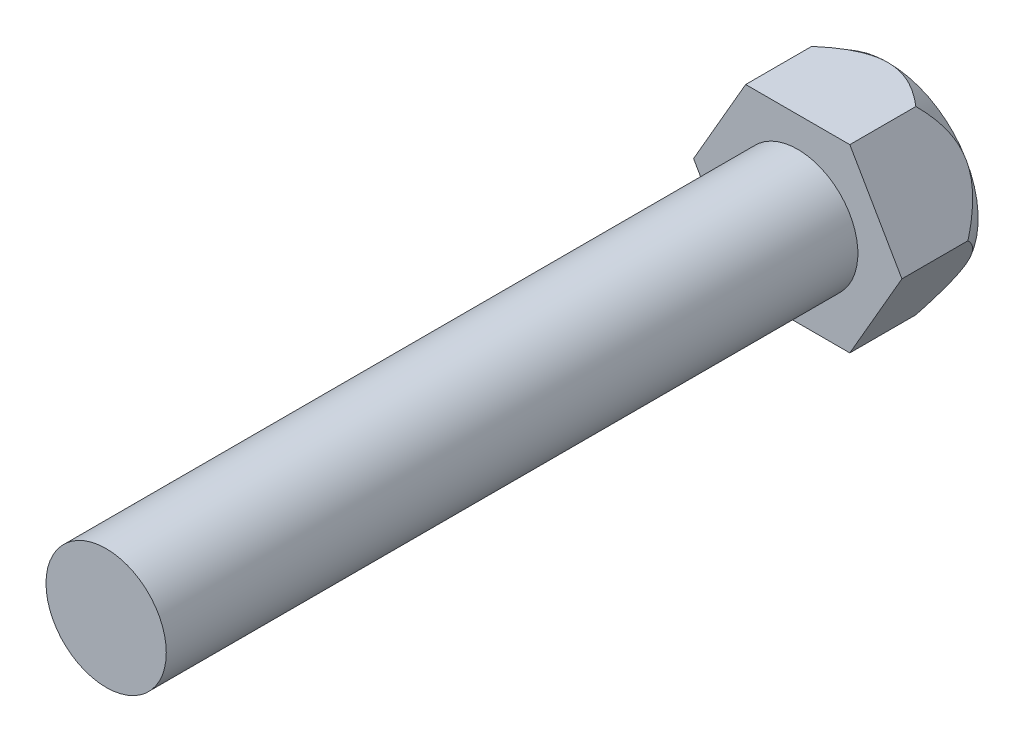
ISO-10303-21;
HEADER;
FILE_DESCRIPTION(('STEP AP214'),'2;1');
FILE_NAME('part.step','',(''),(''),'','','');
FILE_SCHEMA(('AUTOMOTIVE_DESIGN { 1 0 10303 214 1 1 1 1 }'));
ENDSEC;
DATA;
#1=APPLICATION_CONTEXT('core data for automotive mechanical design processes');
#2=APPLICATION_PROTOCOL_DEFINITION('international standard','automotive_design',2000,#1);
#3=PRODUCT_CONTEXT('',#1,'mechanical');
#4=PRODUCT('Part','Part','',(#3));
#5=PRODUCT_RELATED_PRODUCT_CATEGORY('part','',(#4));
#6=PRODUCT_DEFINITION_FORMATION('','',#4);
#7=PRODUCT_DEFINITION_CONTEXT('part definition',#1,'design');
#8=PRODUCT_DEFINITION('design','',#6,#7);
#9=PRODUCT_DEFINITION_SHAPE('','',#8);
#10=(LENGTH_UNIT() NAMED_UNIT(*) SI_UNIT(.MILLI.,.METRE.));
#11=(NAMED_UNIT(*) PLANE_ANGLE_UNIT() SI_UNIT($,.RADIAN.));
#12=(NAMED_UNIT(*) SI_UNIT($,.STERADIAN.) SOLID_ANGLE_UNIT());
#13=UNCERTAINTY_MEASURE_WITH_UNIT(LENGTH_MEASURE(1.E-05),#10,'distance_accuracy_value','');
#14=(GEOMETRIC_REPRESENTATION_CONTEXT(3) GLOBAL_UNCERTAINTY_ASSIGNED_CONTEXT((#13)) GLOBAL_UNIT_ASSIGNED_CONTEXT((#10,
#11,#12)) REPRESENTATION_CONTEXT('',''));
#15=CARTESIAN_POINT('',(0.,0.,0.));
#16=DIRECTION('',(0.,0.,1.));
#17=DIRECTION('',(1.,0.,0.));
#18=AXIS2_PLACEMENT_3D('',#15,#16,#17);
#19=CARTESIAN_POINT('',(0.,0.,57.5));
#20=DIRECTION('',(0.,0.,-1.));
#21=DIRECTION('',(-1.,0.,0.));
#22=AXIS2_PLACEMENT_3D('',#19,#20,#21);
#23=CYLINDRICAL_SURFACE('',#22,10.);
#24=CARTESIAN_POINT('',(0.,0.,57.5));
#25=DIRECTION('',(0.,0.,1.));
#26=DIRECTION('',(1.,0.,0.));
#27=AXIS2_PLACEMENT_3D('',#24,#25,#26);
#28=CIRCLE('',#27,10.);
#29=CARTESIAN_POINT('',(10.,0.,57.5));
#30=VERTEX_POINT('',#29);
#31=EDGE_CURVE('E148',#30,#30,#28,.T.);
#32=ORIENTED_EDGE('',*,*,#31,.F.);
#33=EDGE_LOOP('',(#32));
#34=FACE_BOUND('',#33,.T.);
#35=CARTESIAN_POINT('',(0.,0.,-57.5));
#36=DIRECTION('',(0.,0.,-1.));
#37=DIRECTION('',(-1.,0.,0.));
#38=AXIS2_PLACEMENT_3D('',#35,#36,#37);
#39=CIRCLE('',#38,10.);
#40=CARTESIAN_POINT('',(-10.,0.,-57.5));
#41=VERTEX_POINT('',#40);
#42=EDGE_CURVE('E146',#41,#41,#39,.T.);
#43=ORIENTED_EDGE('',*,*,#42,.F.);
#44=EDGE_LOOP('',(#43));
#45=FACE_BOUND('',#44,.T.);
#46=ADVANCED_FACE('F40',(#34,#45),#23,.T.);
#47=CARTESIAN_POINT('',(0.,0.,57.5));
#48=DIRECTION('',(0.,0.,1.));
#49=DIRECTION('',(1.,0.,0.));
#50=AXIS2_PLACEMENT_3D('',#47,#48,#49);
#51=PLANE('',#50);
#52=ORIENTED_EDGE('',*,*,#31,.T.);
#53=EDGE_LOOP('',(#52));
#54=FACE_BOUND('',#53,.T.);
#55=ADVANCED_FACE('F233',(#54),#51,.T.);
#56=CARTESIAN_POINT('',(-8.66025403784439,-15.,-72.5));
#57=DIRECTION('',(0.866025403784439,0.5,0.));
#58=DIRECTION('',(-0.5,0.866025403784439,0.));
#59=AXIS2_PLACEMENT_3D('',#56,#57,#58);
#60=PLANE('',#59);
#61=DIRECTION('',(0.,0.,1.));
#62=VECTOR('',#61,1.);
#63=CARTESIAN_POINT('',(-17.3205080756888,0.,-72.5));
#64=LINE('',#63,#62);
#65=CARTESIAN_POINT('',(-17.3205080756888,0.,-68.4807621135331));
#66=VERTEX_POINT('',#65);
#67=CARTESIAN_POINT('',(-17.3205080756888,0.,-57.5));
#68=VERTEX_POINT('',#67);
#69=EDGE_CURVE('E144',#66,#68,#64,.T.);
#70=ORIENTED_EDGE('',*,*,#69,.F.);
#71=CARTESIAN_POINT('',(-17.3206235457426,0.000200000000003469,-68.4805621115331));
#72=CARTESIAN_POINT('',(-17.2300479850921,-0.156681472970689,-68.637426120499));
#73=CARTESIAN_POINT('',(-17.1385624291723,-0.315139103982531,-68.7922150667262));
#74=CARTESIAN_POINT('',(-16.9535845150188,-0.635530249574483,-69.0970249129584));
#75=CARTESIAN_POINT('',(-16.8600915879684,-0.797464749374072,-69.2470444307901));
#76=CARTESIAN_POINT('',(-16.6704659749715,-1.1259059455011,-69.5423822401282));
#77=CARTESIAN_POINT('',(-16.5743219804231,-1.29243222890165,-69.687671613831));
#78=CARTESIAN_POINT('',(-16.3797159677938,-1.62949973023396,-69.9718551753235));
#79=CARTESIAN_POINT('',(-16.2812541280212,-1.80004063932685,-70.1107498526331));
#80=CARTESIAN_POINT('',(-15.9769616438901,-2.32709068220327,-70.5234775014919));
#81=CARTESIAN_POINT('',(-15.7670945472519,-2.69059115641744,-70.7856331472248));
#82=CARTESIAN_POINT('',(-15.3360147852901,-3.43724320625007,-71.2681385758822));
#83=CARTESIAN_POINT('',(-15.1148286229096,-3.8203488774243,-71.4885808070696));
#84=CARTESIAN_POINT('',(-14.7642585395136,-4.42755407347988,-71.7864245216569));
#85=CARTESIAN_POINT('',(-14.6389809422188,-4.64454123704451,-71.883227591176));
#86=CARTESIAN_POINT('',(-14.385145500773,-5.08419711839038,-72.058066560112));
#87=CARTESIAN_POINT('',(-14.2565874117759,-5.30686626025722,-72.136101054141));
#88=CARTESIAN_POINT('',(-13.9977321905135,-5.75521665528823,-72.2704162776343));
#89=CARTESIAN_POINT('',(-13.8674571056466,-5.98085972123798,-72.3268655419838));
#90=CARTESIAN_POINT('',(-13.6049313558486,-6.43556765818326,-72.4168514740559));
#91=CARTESIAN_POINT('',(-13.4726808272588,-6.66463229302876,-72.4503897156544));
#92=CARTESIAN_POINT('',(-13.2059740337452,-7.12658201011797,-72.4934006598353));
#93=CARTESIAN_POINT('',(-13.0715086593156,-7.35948287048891,-72.502650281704));
#94=CARTESIAN_POINT('',(-12.8027354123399,-7.82501178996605,-72.4960396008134));
#95=CARTESIAN_POINT('',(-12.6684275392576,-8.05763985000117,-72.4801793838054));
#96=CARTESIAN_POINT('',(-12.400784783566,-8.5212107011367,-72.4239623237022));
#97=CARTESIAN_POINT('',(-12.2674530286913,-8.752148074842,-72.3835464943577));
#98=CARTESIAN_POINT('',(-12.003049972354,-9.21010760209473,-72.2797957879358));
#99=CARTESIAN_POINT('',(-11.8719789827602,-9.43712921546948,-72.2164577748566));
#100=CARTESIAN_POINT('',(-11.5753276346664,-9.95094442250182,-72.0477759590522));
#101=CARTESIAN_POINT('',(-11.4107215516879,-10.2360505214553,-71.9355824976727));
#102=CARTESIAN_POINT('',(-11.0872128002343,-10.7963841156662,-71.6821410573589));
#103=CARTESIAN_POINT('',(-10.9283126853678,-11.0716071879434,-71.5408802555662));
#104=CARTESIAN_POINT('',(-10.6157889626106,-11.6129141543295,-71.2338608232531));
#105=CARTESIAN_POINT('',(-10.4621898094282,-11.878955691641,-71.0680035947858));
#106=CARTESIAN_POINT('',(-10.1607574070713,-12.4010519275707,-70.7167667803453));
#107=CARTESIAN_POINT('',(-10.012923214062,-12.6571082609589,-70.5313904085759));
#108=CARTESIAN_POINT('',(-9.76139050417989,-13.0927756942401,-70.1964736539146));
#109=CARTESIAN_POINT('',(-9.65645845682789,-13.274523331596,-70.0506016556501));
#110=CARTESIAN_POINT('',(-9.44924972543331,-13.6334193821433,-69.7515279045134));
#111=CARTESIAN_POINT('',(-9.34697290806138,-13.8105680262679,-69.5983265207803));
#112=CARTESIAN_POINT('',(-9.14600894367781,-14.1586478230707,-69.287365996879));
#113=CARTESIAN_POINT('',(-9.04729436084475,-14.3296264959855,-69.1296774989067));
#114=CARTESIAN_POINT('',(-8.85209596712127,-14.6677200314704,-68.808945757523));
#115=CARTESIAN_POINT('',(-8.75561170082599,-14.8348356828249,-68.6459036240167));
#116=CARTESIAN_POINT('',(-8.66013856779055,-15.0002,-68.4805621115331));
#117=B_SPLINE_CURVE_WITH_KNOTS('',3,(#71,#72,#73,#74,#75,#76,#77,#78,#79,#80,#81,#82,#83,#84,
#85,#86,#87,#88,#89,#90,#91,#92,#93,#94,#95,#96,#97,#98,#99,#100,#101,#102,#103,#104,#105,#106,
#107,#108,#109,#110,#111,#112,#113,#114,#115,#116),.UNSPECIFIED.,.F.,.F.,(4,2,2,2,2,2,2,2,2,2,2,
2,2,2,2,2,2,2,2,2,2,2,4),(0.,0.718895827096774,1.43799812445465,2.16088732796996,
2.88372110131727,4.36659494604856,5.84614282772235,6.65134572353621,7.45660889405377,
8.25544963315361,9.05423549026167,9.86033260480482,10.6664269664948,11.474465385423,
12.2826143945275,13.3243244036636,14.3664949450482,15.4129621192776,16.4592572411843,
17.2258390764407,17.9923823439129,18.7503041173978,19.5080697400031),.UNSPECIFIED.);
#118=CARTESIAN_POINT('',(-12.9903810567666,-7.49999999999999,-72.5));
#119=VERTEX_POINT('',#118);
#120=EDGE_CURVE('E128',#66,#119,#117,.T.);
#121=ORIENTED_EDGE('',*,*,#120,.T.);
#122=CARTESIAN_POINT('',(-8.66025403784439,-15.,-68.4807621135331));
#123=VERTEX_POINT('',#122);
#124=EDGE_CURVE('E198',#119,#123,#117,.T.);
#125=ORIENTED_EDGE('',*,*,#124,.T.);
#126=DIRECTION('',(0.,0.,1.));
#127=VECTOR('',#126,1.);
#128=CARTESIAN_POINT('',(-8.66025403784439,-15.,-72.5));
#129=LINE('',#128,#127);
#130=CARTESIAN_POINT('',(-8.66025403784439,-15.,-57.5));
#131=VERTEX_POINT('',#130);
#132=EDGE_CURVE('E139',#123,#131,#129,.T.);
#133=ORIENTED_EDGE('',*,*,#132,.T.);
#134=DIRECTION('',(-0.5,0.866025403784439,0.));
#135=VECTOR('',#134,1.);
#136=CARTESIAN_POINT('',(-8.66025403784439,-15.,-57.5));
#137=LINE('',#136,#135);
#138=EDGE_CURVE('E253',#131,#68,#137,.T.);
#139=ORIENTED_EDGE('',*,*,#138,.T.);
#140=EDGE_LOOP('',(#70,#121,#125,#133,#139));
#141=FACE_BOUND('',#140,.T.);
#142=ADVANCED_FACE('F228',(#141),#60,.F.);
#143=CARTESIAN_POINT('',(-17.3205080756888,0.,-72.5));
#144=DIRECTION('',(0.866025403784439,-0.5,0.));
#145=DIRECTION('',(0.5,0.866025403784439,0.));
#146=AXIS2_PLACEMENT_3D('',#143,#144,#145);
#147=PLANE('',#146);
#148=DIRECTION('',(0.,0.,1.));
#149=VECTOR('',#148,1.);
#150=CARTESIAN_POINT('',(-8.66025403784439,15.,-72.5));
#151=LINE('',#150,#149);
#152=CARTESIAN_POINT('',(-8.66025403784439,15.,-68.4807621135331));
#153=VERTEX_POINT('',#152);
#154=CARTESIAN_POINT('',(-8.66025403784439,15.,-57.5));
#155=VERTEX_POINT('',#154);
#156=EDGE_CURVE('E137',#153,#155,#151,.T.);
#157=ORIENTED_EDGE('',*,*,#156,.F.);
#158=CARTESIAN_POINT('',(-8.66013856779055,15.0002,-68.4805621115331));
#159=CARTESIAN_POINT('',(-8.75071412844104,14.8433185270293,-68.637426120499));
#160=CARTESIAN_POINT('',(-8.84219968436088,14.6848608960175,-68.7922150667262));
#161=CARTESIAN_POINT('',(-9.02717759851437,14.3644697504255,-69.0970249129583));
#162=CARTESIAN_POINT('',(-9.12067052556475,14.2025352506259,-69.2470444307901));
#163=CARTESIAN_POINT('',(-9.31029613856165,13.8740940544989,-69.5423822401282));
#164=CARTESIAN_POINT('',(-9.40644013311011,13.7075677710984,-69.687671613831));
#165=CARTESIAN_POINT('',(-9.6010461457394,13.370500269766,-69.9718551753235));
#166=CARTESIAN_POINT('',(-9.69950798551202,13.1999593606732,-70.1107498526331));
#167=CARTESIAN_POINT('',(-10.0038004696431,12.6729093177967,-70.5234775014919));
#168=CARTESIAN_POINT('',(-10.2136675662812,12.3094088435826,-70.7856331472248));
#169=CARTESIAN_POINT('',(-10.6447473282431,11.5627567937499,-71.2681385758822));
#170=CARTESIAN_POINT('',(-10.8659334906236,11.1796511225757,-71.4885808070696));
#171=CARTESIAN_POINT('',(-11.2165035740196,10.5724459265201,-71.7864245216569));
#172=CARTESIAN_POINT('',(-11.3417811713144,10.3554587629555,-71.883227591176));
#173=CARTESIAN_POINT('',(-11.5956166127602,9.91580288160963,-72.058066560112));
#174=CARTESIAN_POINT('',(-11.7241747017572,9.69313373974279,-72.136101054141));
#175=CARTESIAN_POINT('',(-11.9830299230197,9.24478334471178,-72.2704162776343));
#176=CARTESIAN_POINT('',(-12.1133050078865,9.01914027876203,-72.3268655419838));
#177=CARTESIAN_POINT('',(-12.3758307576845,8.56443234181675,-72.4168514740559));
#178=CARTESIAN_POINT('',(-12.5080812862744,8.33536770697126,-72.4503897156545));
#179=CARTESIAN_POINT('',(-12.7747880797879,7.87341798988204,-72.4934006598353));
#180=CARTESIAN_POINT('',(-12.9092534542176,7.64051712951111,-72.502650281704));
#181=CARTESIAN_POINT('',(-13.1780267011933,7.17498821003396,-72.4960396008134));
#182=CARTESIAN_POINT('',(-13.3123345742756,6.94236014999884,-72.4801793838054));
#183=CARTESIAN_POINT('',(-13.5799773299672,6.47878929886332,-72.4239623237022));
#184=CARTESIAN_POINT('',(-13.7133090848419,6.24785192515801,-72.3835464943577));
#185=CARTESIAN_POINT('',(-13.9777121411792,5.78989239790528,-72.2797957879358));
#186=CARTESIAN_POINT('',(-14.108783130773,5.56287078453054,-72.2164577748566));
#187=CARTESIAN_POINT('',(-14.4054344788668,5.0490555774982,-72.0477759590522));
#188=CARTESIAN_POINT('',(-14.5700405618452,4.76394947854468,-71.9355824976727));
#189=CARTESIAN_POINT('',(-14.8935493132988,4.20361588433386,-71.6821410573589));
#190=CARTESIAN_POINT('',(-15.0524494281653,3.92839281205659,-71.5408802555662));
#191=CARTESIAN_POINT('',(-15.3649731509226,3.38708584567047,-71.2338608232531));
#192=CARTESIAN_POINT('',(-15.518572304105,3.12104430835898,-71.0680035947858));
#193=CARTESIAN_POINT('',(-15.8200047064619,2.59894807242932,-70.7167667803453));
#194=CARTESIAN_POINT('',(-15.9678388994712,2.34289173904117,-70.5313904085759));
#195=CARTESIAN_POINT('',(-16.2193716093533,1.90722430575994,-70.1964736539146));
#196=CARTESIAN_POINT('',(-16.3243036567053,1.72547666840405,-70.0506016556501));
#197=CARTESIAN_POINT('',(-16.5315123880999,1.36658061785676,-69.7515279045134));
#198=CARTESIAN_POINT('',(-16.6337892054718,1.18943197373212,-69.5983265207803));
#199=CARTESIAN_POINT('',(-16.8347531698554,0.841352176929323,-69.287365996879));
#200=CARTESIAN_POINT('',(-16.9334677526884,0.670373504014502,-69.1296774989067));
#201=CARTESIAN_POINT('',(-17.1286661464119,0.332279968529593,-68.808945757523));
#202=CARTESIAN_POINT('',(-17.2251504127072,0.16516431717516,-68.6459036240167));
#203=CARTESIAN_POINT('',(-17.3206235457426,-0.000199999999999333,-68.4805621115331));
#204=B_SPLINE_CURVE_WITH_KNOTS('',3,(#158,#159,#160,#161,#162,#163,#164,#165,#166,#167,#168,
#169,#170,#171,#172,#173,#174,#175,#176,#177,#178,#179,#180,#181,#182,#183,#184,#185,#186,#187,
#188,#189,#190,#191,#192,#193,#194,#195,#196,#197,#198,#199,#200,#201,#202,#203),.UNSPECIFIED.,
.F.,.F.,(4,2,2,2,2,2,2,2,2,2,2,2,2,2,2,2,2,2,2,2,2,2,4),(0.,0.718895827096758,1.43799812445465,
2.16088732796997,2.88372110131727,4.36659494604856,5.84614282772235,6.65134572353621,
7.45660889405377,8.25544963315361,9.05423549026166,9.86033260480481,10.6664269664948,
11.474465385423,12.2826143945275,13.3243244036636,14.3664949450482,15.4129621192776,
16.4592572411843,17.2258390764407,17.9923823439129,18.7503041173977,19.5080697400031),.UNSPECIFIED.);
#205=CARTESIAN_POINT('',(-12.9903810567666,7.49999999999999,-72.5));
#206=VERTEX_POINT('',#205);
#207=EDGE_CURVE('E216',#153,#206,#204,.T.);
#208=ORIENTED_EDGE('',*,*,#207,.T.);
#209=EDGE_CURVE('E117',#206,#66,#204,.T.);
#210=ORIENTED_EDGE('',*,*,#209,.T.);
#211=ORIENTED_EDGE('',*,*,#69,.T.);
#212=DIRECTION('',(0.5,0.866025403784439,0.));
#213=VECTOR('',#212,1.);
#214=CARTESIAN_POINT('',(-17.3205080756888,0.,-57.5));
#215=LINE('',#214,#213);
#216=EDGE_CURVE('E258',#68,#155,#215,.T.);
#217=ORIENTED_EDGE('',*,*,#216,.T.);
#218=EDGE_LOOP('',(#157,#208,#210,#211,#217));
#219=FACE_BOUND('',#218,.T.);
#220=ADVANCED_FACE('F224',(#219),#147,.F.);
#221=CARTESIAN_POINT('',(-8.66025403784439,15.,-72.5));
#222=DIRECTION('',(0.,-1.,0.));
#223=DIRECTION('',(1.,0.,0.));
#224=AXIS2_PLACEMENT_3D('',#221,#222,#223);
#225=PLANE('',#224);
#226=DIRECTION('',(0.,0.,1.));
#227=VECTOR('',#226,1.);
#228=CARTESIAN_POINT('',(8.6602540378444,15.,-72.5));
#229=LINE('',#228,#227);
#230=CARTESIAN_POINT('',(8.66025403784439,15.,-68.4807621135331));
#231=VERTEX_POINT('',#230);
#232=CARTESIAN_POINT('',(8.6602540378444,15.,-57.5));
#233=VERTEX_POINT('',#232);
#234=EDGE_CURVE('E134',#231,#233,#229,.T.);
#235=ORIENTED_EDGE('',*,*,#234,.F.);
#236=CARTESIAN_POINT('',(-15.1430364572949,15.,-61.5628171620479));
#237=CARTESIAN_POINT('',(-14.8288624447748,15.,-61.9493371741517));
#238=CARTESIAN_POINT('',(-14.5118354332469,15.,-62.3335731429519));
#239=CARTESIAN_POINT('',(-13.8709660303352,15.,-63.0964876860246));
#240=CARTESIAN_POINT('',(-13.547121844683,15.,-63.4751647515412));
#241=CARTESIAN_POINT('',(-12.888615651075,15.,-64.229268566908));
#242=CARTESIAN_POINT('',(-12.5538808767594,15.,-64.6046319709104));
#243=CARTESIAN_POINT('',(-11.8751992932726,15.,-65.3468939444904));
#244=CARTESIAN_POINT('',(-11.5312533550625,15.,-65.7137933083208));
#245=CARTESIAN_POINT('',(-10.8097712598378,15.,-66.4606711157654));
#246=CARTESIAN_POINT('',(-10.4315054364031,15.,-66.8399479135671));
#247=CARTESIAN_POINT('',(-9.66014183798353,15.,-67.5834050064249));
#248=CARTESIAN_POINT('',(-9.26704030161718,15.,-67.9475814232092));
#249=CARTESIAN_POINT('',(-8.46472785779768,15.,-68.6546286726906));
#250=CARTESIAN_POINT('',(-8.05558556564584,15.,-68.9975768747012));
#251=CARTESIAN_POINT('',(-7.21655079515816,15.,-69.6568770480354));
#252=CARTESIAN_POINT('',(-6.78667276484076,15.,-69.9732471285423));
#253=CARTESIAN_POINT('',(-6.05521199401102,15.,-70.4667593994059));
#254=CARTESIAN_POINT('',(-5.76061927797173,15.,-70.6542389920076));
#255=CARTESIAN_POINT('',(-5.15990320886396,15.,-71.0101475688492));
#256=CARTESIAN_POINT('',(-4.8537761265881,15.,-71.1785703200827));
#257=CARTESIAN_POINT('',(-4.23259610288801,15.,-71.4903535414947));
#258=CARTESIAN_POINT('',(-3.91765731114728,15.,-71.6339394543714));
#259=CARTESIAN_POINT('',(-3.27637761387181,15.,-71.8929292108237));
#260=CARTESIAN_POINT('',(-2.95004205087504,15.,-72.0083460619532));
#261=CARTESIAN_POINT('',(-2.37476383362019,15.,-72.1797138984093));
#262=CARTESIAN_POINT('',(-2.1280980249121,15.,-72.2433203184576));
#263=CARTESIAN_POINT('',(-1.63043023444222,15.,-72.3504695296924));
#264=CARTESIAN_POINT('',(-1.37942888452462,15.,-72.3940152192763));
#265=CARTESIAN_POINT('',(-0.874677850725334,15.,-72.459515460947));
#266=CARTESIAN_POINT('',(-0.62092902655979,15.,-72.4814765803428));
#267=CARTESIAN_POINT('',(-0.112466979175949,15.,-72.5029987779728));
#268=CARTESIAN_POINT('',(0.142246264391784,15.,-72.5025593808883));
#269=CARTESIAN_POINT('',(0.650584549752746,15.,-72.4792982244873));
#270=CARTESIAN_POINT('',(0.904209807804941,15.,-72.4564811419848));
#271=CARTESIAN_POINT('',(1.40856698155,15.,-72.3893371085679));
#272=CARTESIAN_POINT('',(1.65929889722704,15.,-72.345010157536));
#273=CARTESIAN_POINT('',(2.15653293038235,15.,-72.2363487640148));
#274=CARTESIAN_POINT('',(2.40303202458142,15.,-72.1720006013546));
#275=CARTESIAN_POINT('',(2.89057908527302,15.,-72.0252653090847));
#276=CARTESIAN_POINT('',(3.1316262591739,15.,-71.9428755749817));
#277=CARTESIAN_POINT('',(3.74664508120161,15.,-71.7093931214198));
#278=CARTESIAN_POINT('',(4.11606200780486,15.,-71.5462721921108));
#279=CARTESIAN_POINT('',(4.83910271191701,15.,-71.1880916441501));
#280=CARTESIAN_POINT('',(5.19271548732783,15.,-70.9930102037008));
#281=CARTESIAN_POINT('',(5.71361473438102,15.,-70.6804817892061));
#282=CARTESIAN_POINT('',(5.88658505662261,15.,-70.5723376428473));
#283=CARTESIAN_POINT('',(6.22884197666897,15.,-70.3503543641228));
#284=CARTESIAN_POINT('',(6.39812853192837,15.,-70.2365151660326));
#285=CARTESIAN_POINT('',(6.73310833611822,15.,-70.0038653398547));
#286=CARTESIAN_POINT('',(6.89880341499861,15.,-69.885057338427));
#287=CARTESIAN_POINT('',(7.22688616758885,15.,-69.6429808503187));
#288=CARTESIAN_POINT('',(7.3892739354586,15.,-69.5197124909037));
#289=CARTESIAN_POINT('',(7.89977326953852,15.,-69.1221832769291));
#290=CARTESIAN_POINT('',(8.2421460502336,15.,-68.8405291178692));
#291=CARTESIAN_POINT('',(8.91432900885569,15.,-68.2625461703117));
#292=CARTESIAN_POINT('',(9.24413542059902,15.,-67.9662130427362));
#293=CARTESIAN_POINT('',(9.89322695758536,15.,-67.3615873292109));
#294=CARTESIAN_POINT('',(10.2125003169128,15.,-67.0532821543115));
#295=CARTESIAN_POINT('',(10.8416304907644,15.,-66.4273057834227));
#296=CARTESIAN_POINT('',(11.151488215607,15.,-66.1096354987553));
#297=CARTESIAN_POINT('',(11.7648493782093,15.,-65.4647678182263));
#298=CARTESIAN_POINT('',(12.0683063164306,15.,-65.1375263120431));
#299=CARTESIAN_POINT('',(12.6681175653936,15.,-64.476600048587));
#300=CARTESIAN_POINT('',(12.9644717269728,15.,-64.1429151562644));
#301=CARTESIAN_POINT('',(13.550813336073,15.,-63.4703500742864));
#302=CARTESIAN_POINT('',(13.8408044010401,15.,-63.1314730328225));
#303=CARTESIAN_POINT('',(14.4153645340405,15.,-62.4491486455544));
#304=CARTESIAN_POINT('',(14.6999334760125,15.,-62.1057011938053));
#305=CARTESIAN_POINT('',(15.4902870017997,15.,-61.1383168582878));
#306=CARTESIAN_POINT('',(15.9907295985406,15.,-60.510013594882));
#307=CARTESIAN_POINT('',(16.979238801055,15.,-59.2436324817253));
#308=CARTESIAN_POINT('',(17.4673034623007,15.,-58.6055531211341));
#309=CARTESIAN_POINT('',(18.4272478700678,15.,-57.3297012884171));
#310=CARTESIAN_POINT('',(18.899253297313,15.,-56.69202324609));
#311=CARTESIAN_POINT('',(19.6009933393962,15.,-55.7310778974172));
#312=CARTESIAN_POINT('',(19.8338307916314,15.,-55.4100686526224));
#313=CARTESIAN_POINT('',(20.2976048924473,15.,-54.766685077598));
#314=CARTESIAN_POINT('',(20.5285415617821,15.,-54.4443107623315));
#315=CARTESIAN_POINT('',(20.7586135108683,15.,-54.1213199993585));
#316=B_SPLINE_CURVE_WITH_KNOTS('',3,(#236,#237,#238,#239,#240,#241,#242,#243,#244,#245,#246,
#247,#248,#249,#250,#251,#252,#253,#254,#255,#256,#257,#258,#259,#260,#261,#262,#263,#264,#265,
#266,#267,#268,#269,#270,#271,#272,#273,#274,#275,#276,#277,#278,#279,#280,#281,#282,#283,#284,
#285,#286,#287,#288,#289,#290,#291,#292,#293,#294,#295,#296,#297,#298,#299,#300,#301,#302,#303,
#304,#305,#306,#307,#308,#309,#310,#311,#312,#313,#314,#315),.UNSPECIFIED.,.F.,.F.,(4,2,2,2,2,2,
2,2,2,2,2,2,2,2,2,2,2,2,2,2,2,2,2,2,2,2,2,2,2,2,2,2,2,2,2,2,2,2,2,4),(0.,1.4943251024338,
2.9890485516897,4.49772602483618,6.00626134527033,7.61292272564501,9.21999422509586,
10.820814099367,12.4205342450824,13.4675378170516,14.5148828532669,15.5521557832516,
16.5889488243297,17.3524190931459,18.1157790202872,18.8789066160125,19.6420504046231,
20.4050347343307,21.1680190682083,21.9315274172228,22.6951460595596,23.9045742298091,
25.114831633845,25.7267242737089,26.3386239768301,26.9502042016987,27.5617669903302,
28.8911898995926,30.2210081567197,31.5522647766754,32.8833922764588,34.2221358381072,
35.5609074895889,36.8988972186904,38.2369180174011,40.6464425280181,43.0563432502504,
45.4363419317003,46.6260180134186,47.8156810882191),.UNSPECIFIED.);
#317=CARTESIAN_POINT('',(0.,15.,-72.5));
#318=VERTEX_POINT('',#317);
#319=EDGE_CURVE('E260',#231,#318,#316,.F.);
#320=ORIENTED_EDGE('',*,*,#319,.T.);
#321=EDGE_CURVE('E217',#318,#153,#316,.F.);
#322=ORIENTED_EDGE('',*,*,#321,.T.);
#323=ORIENTED_EDGE('',*,*,#156,.T.);
#324=DIRECTION('',(1.,0.,0.));
#325=VECTOR('',#324,1.);
#326=CARTESIAN_POINT('',(-8.66025403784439,15.,-57.5));
#327=LINE('',#326,#325);
#328=EDGE_CURVE('E261',#155,#233,#327,.T.);
#329=ORIENTED_EDGE('',*,*,#328,.T.);
#330=EDGE_LOOP('',(#235,#320,#322,#323,#329));
#331=FACE_BOUND('',#330,.T.);
#332=ADVANCED_FACE('F227',(#331),#225,.F.);
#333=CARTESIAN_POINT('',(8.6602540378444,15.,-72.5));
#334=DIRECTION('',(-0.866025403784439,-0.5,0.));
#335=DIRECTION('',(0.5,-0.866025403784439,0.));
#336=AXIS2_PLACEMENT_3D('',#333,#334,#335);
#337=PLANE('',#336);
#338=DIRECTION('',(0.,0.,1.));
#339=VECTOR('',#338,1.);
#340=CARTESIAN_POINT('',(17.3205080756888,0.,-72.5));
#341=LINE('',#340,#339);
#342=CARTESIAN_POINT('',(17.3205080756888,0.,-68.4807621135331));
#343=VERTEX_POINT('',#342);
#344=CARTESIAN_POINT('',(17.3205080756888,0.,-57.5));
#345=VERTEX_POINT('',#344);
#346=EDGE_CURVE('E125',#343,#345,#341,.T.);
#347=ORIENTED_EDGE('',*,*,#346,.F.);
#348=CARTESIAN_POINT('',(17.3206235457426,-0.000200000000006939,-68.4805621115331));
#349=CARTESIAN_POINT('',(17.2300479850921,0.15668147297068,-68.637426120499));
#350=CARTESIAN_POINT('',(17.1385624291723,0.31513910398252,-68.7922150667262));
#351=CARTESIAN_POINT('',(16.9535845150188,0.635530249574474,-69.0970249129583));
#352=CARTESIAN_POINT('',(16.8600915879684,0.797464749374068,-69.2470444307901));
#353=CARTESIAN_POINT('',(16.6704659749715,1.1259059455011,-69.5423822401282));
#354=CARTESIAN_POINT('',(16.5743219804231,1.29243222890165,-69.687671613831));
#355=CARTESIAN_POINT('',(16.3797159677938,1.62949973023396,-69.9718551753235));
#356=CARTESIAN_POINT('',(16.2812541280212,1.80004063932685,-70.1107498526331));
#357=CARTESIAN_POINT('',(15.9769616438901,2.32709068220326,-70.5234775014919));
#358=CARTESIAN_POINT('',(15.7670945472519,2.69059115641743,-70.7856331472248));
#359=CARTESIAN_POINT('',(15.3360147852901,3.43724320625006,-71.2681385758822));
#360=CARTESIAN_POINT('',(15.1148286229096,3.82034887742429,-71.4885808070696));
#361=CARTESIAN_POINT('',(14.7642585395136,4.42755407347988,-71.7864245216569));
#362=CARTESIAN_POINT('',(14.6389809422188,4.6445412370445,-71.883227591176));
#363=CARTESIAN_POINT('',(14.385145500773,5.08419711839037,-72.058066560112));
#364=CARTESIAN_POINT('',(14.2565874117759,5.30686626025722,-72.136101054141));
#365=CARTESIAN_POINT('',(13.9977321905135,5.75521665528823,-72.2704162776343));
#366=CARTESIAN_POINT('',(13.8674571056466,5.98085972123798,-72.3268655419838));
#367=CARTESIAN_POINT('',(13.6049313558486,6.43556765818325,-72.4168514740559));
#368=CARTESIAN_POINT('',(13.4726808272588,6.66463229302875,-72.4503897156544));
#369=CARTESIAN_POINT('',(13.2059740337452,7.12658201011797,-72.4934006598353));
#370=CARTESIAN_POINT('',(13.0715086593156,7.3594828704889,-72.502650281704));
#371=CARTESIAN_POINT('',(12.8027354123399,7.82501178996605,-72.4960396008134));
#372=CARTESIAN_POINT('',(12.6684275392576,8.05763985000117,-72.4801793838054));
#373=CARTESIAN_POINT('',(12.400784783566,8.52121070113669,-72.4239623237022));
#374=CARTESIAN_POINT('',(12.2674530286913,8.752148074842,-72.3835464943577));
#375=CARTESIAN_POINT('',(12.003049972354,9.21010760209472,-72.2797957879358));
#376=CARTESIAN_POINT('',(11.8719789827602,9.43712921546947,-72.2164577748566));
#377=CARTESIAN_POINT('',(11.5753276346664,9.95094442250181,-72.0477759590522));
#378=CARTESIAN_POINT('',(11.4107215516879,10.2360505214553,-71.9355824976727));
#379=CARTESIAN_POINT('',(11.0872128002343,10.7963841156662,-71.6821410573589));
#380=CARTESIAN_POINT('',(10.9283126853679,11.0716071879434,-71.5408802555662));
#381=CARTESIAN_POINT('',(10.6157889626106,11.6129141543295,-71.2338608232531));
#382=CARTESIAN_POINT('',(10.4621898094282,11.878955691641,-71.0680035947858));
#383=CARTESIAN_POINT('',(10.1607574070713,12.4010519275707,-70.7167667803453));
#384=CARTESIAN_POINT('',(10.012923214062,12.6571082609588,-70.5313904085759));
#385=CARTESIAN_POINT('',(9.76139050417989,13.0927756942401,-70.1964736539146));
#386=CARTESIAN_POINT('',(9.6564584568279,13.274523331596,-70.0506016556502));
#387=CARTESIAN_POINT('',(9.44924972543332,13.6334193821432,-69.7515279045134));
#388=CARTESIAN_POINT('',(9.34697290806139,13.8105680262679,-69.5983265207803));
#389=CARTESIAN_POINT('',(9.14600894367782,14.1586478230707,-69.287365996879));
#390=CARTESIAN_POINT('',(9.04729436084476,14.3296264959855,-69.1296774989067));
#391=CARTESIAN_POINT('',(8.85209596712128,14.6677200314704,-68.808945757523));
#392=CARTESIAN_POINT('',(8.755611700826,14.8348356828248,-68.6459036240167));
#393=CARTESIAN_POINT('',(8.66013856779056,15.0002,-68.4805621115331));
#394=B_SPLINE_CURVE_WITH_KNOTS('',3,(#348,#349,#350,#351,#352,#353,#354,#355,#356,#357,#358,
#359,#360,#361,#362,#363,#364,#365,#366,#367,#368,#369,#370,#371,#372,#373,#374,#375,#376,#377,
#378,#379,#380,#381,#382,#383,#384,#385,#386,#387,#388,#389,#390,#391,#392,#393),.UNSPECIFIED.,
.F.,.F.,(4,2,2,2,2,2,2,2,2,2,2,2,2,2,2,2,2,2,2,2,2,2,4),(0.,0.718895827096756,1.43799812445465,
2.16088732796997,2.88372110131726,4.36659494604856,5.84614282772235,6.65134572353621,
7.45660889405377,8.25544963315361,9.05423549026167,9.86033260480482,10.6664269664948,
11.474465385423,12.2826143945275,13.3243244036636,14.3664949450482,15.4129621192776,
16.4592572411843,17.2258390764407,17.9923823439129,18.7503041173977,19.5080697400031),.UNSPECIFIED.);
#395=CARTESIAN_POINT('',(12.9903810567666,7.49999999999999,-72.5));
#396=VERTEX_POINT('',#395);
#397=EDGE_CURVE('E109',#343,#396,#394,.T.);
#398=ORIENTED_EDGE('',*,*,#397,.T.);
#399=EDGE_CURVE('E119',#396,#231,#394,.T.);
#400=ORIENTED_EDGE('',*,*,#399,.T.);
#401=ORIENTED_EDGE('',*,*,#234,.T.);
#402=DIRECTION('',(0.5,-0.866025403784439,0.));
#403=VECTOR('',#402,1.);
#404=CARTESIAN_POINT('',(8.6602540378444,15.,-57.5));
#405=LINE('',#404,#403);
#406=EDGE_CURVE('E132',#233,#345,#405,.T.);
#407=ORIENTED_EDGE('',*,*,#406,.T.);
#408=EDGE_LOOP('',(#347,#398,#400,#401,#407));
#409=FACE_BOUND('',#408,.T.);
#410=ADVANCED_FACE('F130',(#409),#337,.F.);
#411=CARTESIAN_POINT('',(17.3205080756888,0.,-72.5));
#412=DIRECTION('',(-0.866025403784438,0.5,0.));
#413=DIRECTION('',(-0.5,-0.866025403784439,0.));
#414=AXIS2_PLACEMENT_3D('',#411,#412,#413);
#415=PLANE('',#414);
#416=DIRECTION('',(0.,0.,1.));
#417=VECTOR('',#416,1.);
#418=CARTESIAN_POINT('',(8.66025403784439,-15.,-72.5));
#419=LINE('',#418,#417);
#420=CARTESIAN_POINT('',(8.66025403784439,-15.,-68.4807621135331));
#421=VERTEX_POINT('',#420);
#422=CARTESIAN_POINT('',(8.66025403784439,-15.,-57.5));
#423=VERTEX_POINT('',#422);
#424=EDGE_CURVE('E135',#421,#423,#419,.T.);
#425=ORIENTED_EDGE('',*,*,#424,.F.);
#426=CARTESIAN_POINT('',(8.66013856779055,-15.0002,-68.4805621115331));
#427=CARTESIAN_POINT('',(8.75071412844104,-14.8433185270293,-68.637426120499));
#428=CARTESIAN_POINT('',(8.84219968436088,-14.6848608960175,-68.7922150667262));
#429=CARTESIAN_POINT('',(9.02717759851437,-14.3644697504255,-69.0970249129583));
#430=CARTESIAN_POINT('',(9.12067052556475,-14.2025352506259,-69.2470444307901));
#431=CARTESIAN_POINT('',(9.31029613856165,-13.8740940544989,-69.5423822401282));
#432=CARTESIAN_POINT('',(9.40644013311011,-13.7075677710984,-69.687671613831));
#433=CARTESIAN_POINT('',(9.60104614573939,-13.370500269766,-69.9718551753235));
#434=CARTESIAN_POINT('',(9.69950798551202,-13.1999593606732,-70.1107498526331));
#435=CARTESIAN_POINT('',(10.0038004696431,-12.6729093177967,-70.5234775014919));
#436=CARTESIAN_POINT('',(10.2136675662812,-12.3094088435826,-70.7856331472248));
#437=CARTESIAN_POINT('',(10.6447473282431,-11.5627567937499,-71.2681385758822));
#438=CARTESIAN_POINT('',(10.8659334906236,-11.1796511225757,-71.4885808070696));
#439=CARTESIAN_POINT('',(11.2165035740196,-10.5724459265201,-71.7864245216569));
#440=CARTESIAN_POINT('',(11.3417811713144,-10.3554587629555,-71.883227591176));
#441=CARTESIAN_POINT('',(11.5956166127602,-9.91580288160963,-72.058066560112));
#442=CARTESIAN_POINT('',(11.7241747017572,-9.69313373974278,-72.136101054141));
#443=CARTESIAN_POINT('',(11.9830299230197,-9.24478334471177,-72.2704162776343));
#444=CARTESIAN_POINT('',(12.1133050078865,-9.01914027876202,-72.3268655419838));
#445=CARTESIAN_POINT('',(12.3758307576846,-8.56443234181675,-72.4168514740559));
#446=CARTESIAN_POINT('',(12.5080812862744,-8.33536770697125,-72.4503897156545));
#447=CARTESIAN_POINT('',(12.774788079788,-7.87341798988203,-72.4934006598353));
#448=CARTESIAN_POINT('',(12.9092534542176,-7.6405171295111,-72.502650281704));
#449=CARTESIAN_POINT('',(13.1780267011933,-7.17498821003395,-72.4960396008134));
#450=CARTESIAN_POINT('',(13.3123345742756,-6.94236014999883,-72.4801793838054));
#451=CARTESIAN_POINT('',(13.5799773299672,-6.47878929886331,-72.4239623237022));
#452=CARTESIAN_POINT('',(13.7133090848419,-6.247851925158,-72.3835464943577));
#453=CARTESIAN_POINT('',(13.9777121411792,-5.78989239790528,-72.2797957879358));
#454=CARTESIAN_POINT('',(14.108783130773,-5.56287078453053,-72.2164577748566));
#455=CARTESIAN_POINT('',(14.4054344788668,-5.04905557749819,-72.0477759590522));
#456=CARTESIAN_POINT('',(14.5700405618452,-4.76394947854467,-71.9355824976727));
#457=CARTESIAN_POINT('',(14.8935493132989,-4.20361588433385,-71.6821410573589));
#458=CARTESIAN_POINT('',(15.0524494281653,-3.92839281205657,-71.5408802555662));
#459=CARTESIAN_POINT('',(15.3649731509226,-3.38708584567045,-71.2338608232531));
#460=CARTESIAN_POINT('',(15.518572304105,-3.12104430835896,-71.0680035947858));
#461=CARTESIAN_POINT('',(15.8200047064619,-2.5989480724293,-70.7167667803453));
#462=CARTESIAN_POINT('',(15.9678388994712,-2.34289173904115,-70.5313904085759));
#463=CARTESIAN_POINT('',(16.2193716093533,-1.90722430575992,-70.1964736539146));
#464=CARTESIAN_POINT('',(16.3243036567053,-1.72547666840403,-70.0506016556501));
#465=CARTESIAN_POINT('',(16.5315123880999,-1.36658061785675,-69.7515279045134));
#466=CARTESIAN_POINT('',(16.6337892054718,-1.18943197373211,-69.5983265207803));
#467=CARTESIAN_POINT('',(16.8347531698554,-0.841352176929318,-69.287365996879));
#468=CARTESIAN_POINT('',(16.9334677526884,-0.6703735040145,-69.1296774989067));
#469=CARTESIAN_POINT('',(17.1286661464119,-0.332279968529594,-68.808945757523));
#470=CARTESIAN_POINT('',(17.2251504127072,-0.165164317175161,-68.6459036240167));
#471=CARTESIAN_POINT('',(17.3206235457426,0.000199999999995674,-68.4805621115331));
#472=B_SPLINE_CURVE_WITH_KNOTS('',3,(#426,#427,#428,#429,#430,#431,#432,#433,#434,#435,#436,
#437,#438,#439,#440,#441,#442,#443,#444,#445,#446,#447,#448,#449,#450,#451,#452,#453,#454,#455,
#456,#457,#458,#459,#460,#461,#462,#463,#464,#465,#466,#467,#468,#469,#470,#471),.UNSPECIFIED.,
.F.,.F.,(4,2,2,2,2,2,2,2,2,2,2,2,2,2,2,2,2,2,2,2,2,2,4),(0.,0.718895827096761,1.43799812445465,
2.16088732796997,2.88372110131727,4.36659494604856,5.84614282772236,6.65134572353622,
7.45660889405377,8.25544963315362,9.05423549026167,9.86033260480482,10.6664269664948,
11.474465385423,12.2826143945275,13.3243244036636,14.3664949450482,15.4129621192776,
16.4592572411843,17.2258390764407,17.9923823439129,18.7503041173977,19.5080697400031),.UNSPECIFIED.);
#473=CARTESIAN_POINT('',(12.9903810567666,-7.49999999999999,-72.5));
#474=VERTEX_POINT('',#473);
#475=EDGE_CURVE('E127',#421,#474,#472,.T.);
#476=ORIENTED_EDGE('',*,*,#475,.T.);
#477=EDGE_CURVE('E62',#474,#343,#472,.T.);
#478=ORIENTED_EDGE('',*,*,#477,.T.);
#479=ORIENTED_EDGE('',*,*,#346,.T.);
#480=DIRECTION('',(-0.5,-0.866025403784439,0.));
#481=VECTOR('',#480,1.);
#482=CARTESIAN_POINT('',(17.3205080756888,0.,-57.5));
#483=LINE('',#482,#481);
#484=EDGE_CURVE('E267',#345,#423,#483,.T.);
#485=ORIENTED_EDGE('',*,*,#484,.T.);
#486=EDGE_LOOP('',(#425,#476,#478,#479,#485));
#487=FACE_BOUND('',#486,.T.);
#488=ADVANCED_FACE('F123',(#487),#415,.F.);
#489=CARTESIAN_POINT('',(8.66025403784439,-15.,-72.5));
#490=DIRECTION('',(0.,1.,0.));
#491=DIRECTION('',(-1.,0.,0.));
#492=AXIS2_PLACEMENT_3D('',#489,#490,#491);
#493=PLANE('',#492);
#494=ORIENTED_EDGE('',*,*,#132,.F.);
#495=CARTESIAN_POINT('',(-15.1430364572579,-15.,-61.5628171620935));
#496=CARTESIAN_POINT('',(-14.8288624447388,-15.,-61.9493371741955));
#497=CARTESIAN_POINT('',(-14.511835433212,-15.,-62.3335731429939));
#498=CARTESIAN_POINT('',(-13.8709660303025,-15.,-63.096487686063));
#499=CARTESIAN_POINT('',(-13.5471218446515,-15.,-63.4751647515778));
#500=CARTESIAN_POINT('',(-12.8886156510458,-15.,-64.229268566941));
#501=CARTESIAN_POINT('',(-12.5538808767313,-15.,-64.6046319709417));
#502=CARTESIAN_POINT('',(-11.8751992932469,-15.,-65.3468939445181));
#503=CARTESIAN_POINT('',(-11.5312533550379,-15.,-65.7137933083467));
#504=CARTESIAN_POINT('',(-10.8097712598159,-15.,-66.4606711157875));
#505=CARTESIAN_POINT('',(-10.4315054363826,-15.,-66.8399479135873));
#506=CARTESIAN_POINT('',(-9.66014183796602,-15.,-67.5834050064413));
#507=CARTESIAN_POINT('',(-9.26704030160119,-15.,-67.9475814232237));
#508=CARTESIAN_POINT('',(-8.46472785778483,-15.,-68.6546286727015));
#509=CARTESIAN_POINT('',(-8.0555855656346,-15.,-68.9975768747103));
#510=CARTESIAN_POINT('',(-7.21655079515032,-15.,-69.6568770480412));
#511=CARTESIAN_POINT('',(-6.7866727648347,-15.,-69.9732471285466));
#512=CARTESIAN_POINT('',(-6.05521199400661,-15.,-70.4667593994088));
#513=CARTESIAN_POINT('',(-5.76061927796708,-15.,-70.6542389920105));
#514=CARTESIAN_POINT('',(-5.1599032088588,-15.,-71.0101475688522));
#515=CARTESIAN_POINT('',(-4.85377612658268,-15.,-71.1785703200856));
#516=CARTESIAN_POINT('',(-4.23259610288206,-15.,-71.4903535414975));
#517=CARTESIAN_POINT('',(-3.91765731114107,-15.,-71.6339394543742));
#518=CARTESIAN_POINT('',(-3.27637761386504,-15.,-71.8929292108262));
#519=CARTESIAN_POINT('',(-2.950042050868,-15.,-72.0083460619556));
#520=CARTESIAN_POINT('',(-2.37476383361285,-15.,-72.1797138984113));
#521=CARTESIAN_POINT('',(-2.12809802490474,-15.,-72.2433203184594));
#522=CARTESIAN_POINT('',(-1.63043023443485,-15.,-72.3504695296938));
#523=CARTESIAN_POINT('',(-1.37942888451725,-15.,-72.3940152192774));
#524=CARTESIAN_POINT('',(-0.874677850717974,-15.,-72.4595154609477));
#525=CARTESIAN_POINT('',(-0.620929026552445,-15.,-72.4814765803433));
#526=CARTESIAN_POINT('',(-0.112466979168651,-15.,-72.5029987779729));
#527=CARTESIAN_POINT('',(0.142246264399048,-15.,-72.5025593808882));
#528=CARTESIAN_POINT('',(0.650584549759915,-15.,-72.4792982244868));
#529=CARTESIAN_POINT('',(0.904209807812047,-15.,-72.4564811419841));
#530=CARTESIAN_POINT('',(1.40856698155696,-15.,-72.3893371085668));
#531=CARTESIAN_POINT('',(1.65929889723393,-15.,-72.3450101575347));
#532=CARTESIAN_POINT('',(2.15653293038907,-15.,-72.2363487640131));
#533=CARTESIAN_POINT('',(2.40303202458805,-15.,-72.1720006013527));
#534=CARTESIAN_POINT('',(2.89057908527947,-15.,-72.0252653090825));
#535=CARTESIAN_POINT('',(3.13162625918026,-15.,-71.9428755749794));
#536=CARTESIAN_POINT('',(3.74664508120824,-15.,-71.7093931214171));
#537=CARTESIAN_POINT('',(4.11606200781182,-15.,-71.5462721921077));
#538=CARTESIAN_POINT('',(4.83910271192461,-15.,-71.1880916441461));
#539=CARTESIAN_POINT('',(5.19271548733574,-15.,-70.9930102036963));
#540=CARTESIAN_POINT('',(5.71361473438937,-15.,-70.6804817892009));
#541=CARTESIAN_POINT('',(5.8865850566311,-15.,-70.5723376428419));
#542=CARTESIAN_POINT('',(6.22884197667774,-15.,-70.350354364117));
#543=CARTESIAN_POINT('',(6.39812853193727,-15.,-70.2365151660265));
#544=CARTESIAN_POINT('',(6.7331083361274,-15.,-70.0038653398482));
#545=CARTESIAN_POINT('',(6.89880341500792,-15.,-69.8850573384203));
#546=CARTESIAN_POINT('',(7.22688616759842,-15.,-69.6429808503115));
#547=CARTESIAN_POINT('',(7.3892739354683,-15.,-69.5197124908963));
#548=CARTESIAN_POINT('',(7.89977326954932,-15.,-69.1221832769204));
#549=CARTESIAN_POINT('',(8.24214605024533,-15.,-68.8405291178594));
#550=CARTESIAN_POINT('',(8.91432900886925,-15.,-68.2625461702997));
#551=CARTESIAN_POINT('',(9.24413542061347,-15.,-67.9662130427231));
#552=CARTESIAN_POINT('',(9.89322695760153,-15.,-67.3615873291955));
#553=CARTESIAN_POINT('',(10.2125003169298,-15.,-67.0532821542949));
#554=CARTESIAN_POINT('',(10.841630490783,-15.,-66.4273057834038));
#555=CARTESIAN_POINT('',(11.1514882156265,-15.,-66.1096354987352));
#556=CARTESIAN_POINT('',(11.7648493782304,-15.,-65.4647678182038));
#557=CARTESIAN_POINT('',(12.0683063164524,-15.,-65.1375263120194));
#558=CARTESIAN_POINT('',(12.668117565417,-15.,-64.4766000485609));
#559=CARTESIAN_POINT('',(12.964471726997,-15.,-64.142915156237));
#560=CARTESIAN_POINT('',(13.5508133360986,-15.,-63.4703500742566));
#561=CARTESIAN_POINT('',(13.8408044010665,-15.,-63.1314730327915));
#562=CARTESIAN_POINT('',(14.4153645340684,-15.,-62.4491486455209));
#563=CARTESIAN_POINT('',(14.6999334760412,-15.,-62.1057011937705));
#564=CARTESIAN_POINT('',(15.4902870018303,-15.,-61.1383168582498));
#565=CARTESIAN_POINT('',(15.9907295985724,-15.,-60.5100135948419));
#566=CARTESIAN_POINT('',(16.9792388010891,-15.,-59.243632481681));
#567=CARTESIAN_POINT('',(17.467303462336,-15.,-58.6055531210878));
#568=CARTESIAN_POINT('',(18.4272478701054,-15.,-57.3297012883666));
#569=CARTESIAN_POINT('',(18.8992532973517,-15.,-56.6920232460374));
#570=CARTESIAN_POINT('',(19.6009933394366,-15.,-55.7310778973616));
#571=CARTESIAN_POINT('',(19.8338307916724,-15.,-55.4100686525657));
#572=CARTESIAN_POINT('',(20.2976048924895,-15.,-54.7666850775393));
#573=CARTESIAN_POINT('',(20.5285415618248,-15.,-54.4443107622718));
#574=CARTESIAN_POINT('',(20.7586135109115,-15.,-54.1213199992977));
#575=B_SPLINE_CURVE_WITH_KNOTS('',3,(#495,#496,#497,#498,#499,#500,#501,#502,#503,#504,#505,
#506,#507,#508,#509,#510,#511,#512,#513,#514,#515,#516,#517,#518,#519,#520,#521,#522,#523,#524,
#525,#526,#527,#528,#529,#530,#531,#532,#533,#534,#535,#536,#537,#538,#539,#540,#541,#542,#543,
#544,#545,#546,#547,#548,#549,#550,#551,#552,#553,#554,#555,#556,#557,#558,#559,#560,#561,#562,
#563,#564,#565,#566,#567,#568,#569,#570,#571,#572,#573,#574),.UNSPECIFIED.,.F.,.F.,(4,2,2,2,2,2,
2,2,2,2,2,2,2,2,2,2,2,2,2,2,2,2,2,2,2,2,2,2,2,2,2,2,2,2,2,2,2,2,2,4),(0.,1.49432510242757,
2.98904855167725,4.49772602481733,6.0062613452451,7.61292272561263,9.21999422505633,
10.8208140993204,12.4205342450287,13.4675378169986,14.5148828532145,15.5521557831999,
16.5889488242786,17.3524190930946,18.1157790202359,18.8789066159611,19.6420504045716,
20.4050347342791,21.1680190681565,21.9315274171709,22.6951460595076,23.9045742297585,
25.1148316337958,25.7267242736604,26.3386239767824,26.9502042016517,27.5617669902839,
28.8911898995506,30.2210081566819,31.5522647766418,32.8833922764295,34.2221358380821,
35.5609074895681,36.8988972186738,38.2369180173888,40.6464425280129,43.0563432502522,
45.4363419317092,46.626018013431,47.8156810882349),.UNSPECIFIED.);
#576=CARTESIAN_POINT('',(0.,-15.,-72.5));
#577=VERTEX_POINT('',#576);
#578=EDGE_CURVE('E170',#123,#577,#575,.T.);
#579=ORIENTED_EDGE('',*,*,#578,.T.);
#580=EDGE_CURVE('E55',#577,#421,#575,.T.);
#581=ORIENTED_EDGE('',*,*,#580,.T.);
#582=ORIENTED_EDGE('',*,*,#424,.T.);
#583=DIRECTION('',(-1.,0.,0.));
#584=VECTOR('',#583,1.);
#585=CARTESIAN_POINT('',(8.66025403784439,-15.,-57.5));
#586=LINE('',#585,#584);
#587=EDGE_CURVE('E255',#423,#131,#586,.T.);
#588=ORIENTED_EDGE('',*,*,#587,.T.);
#589=EDGE_LOOP('',(#494,#579,#581,#582,#588));
#590=FACE_BOUND('',#589,.T.);
#591=ADVANCED_FACE('F184',(#590),#493,.F.);
#592=CARTESIAN_POINT('',(0.,0.,-57.5));
#593=DIRECTION('',(0.,0.,-1.));
#594=DIRECTION('',(-1.,0.,0.));
#595=AXIS2_PLACEMENT_3D('',#592,#593,#594);
#596=PLANE('',#595);
#597=ORIENTED_EDGE('',*,*,#42,.T.);
#598=EDGE_LOOP('',(#597));
#599=FACE_BOUND('',#598,.T.);
#600=ORIENTED_EDGE('',*,*,#138,.F.);
#601=ORIENTED_EDGE('',*,*,#587,.F.);
#602=ORIENTED_EDGE('',*,*,#484,.F.);
#603=ORIENTED_EDGE('',*,*,#406,.F.);
#604=ORIENTED_EDGE('',*,*,#328,.F.);
#605=ORIENTED_EDGE('',*,*,#216,.F.);
#606=EDGE_LOOP('',(#600,#601,#602,#603,#604,#605));
#607=FACE_BOUND('',#606,.T.);
#608=ADVANCED_FACE('F245',(#599,#607),#596,.F.);
#609=CARTESIAN_POINT('',(0.,0.,-72.5));
#610=DIRECTION('',(0.,0.,1.));
#611=DIRECTION('',(1.,0.,0.));
#612=AXIS2_PLACEMENT_3D('',#609,#610,#611);
#613=CONICAL_SURFACE('',#612,15.,0.523598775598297);
#614=CARTESIAN_POINT('',(0.,0.,-72.5));
#615=DIRECTION('',(0.,0.,-1.));
#616=DIRECTION('',(-1.,0.,0.));
#617=AXIS2_PLACEMENT_3D('',#614,#615,#616);
#618=CIRCLE('',#617,15.);
#619=EDGE_CURVE('E43',#206,#119,#618,.F.);
#620=ORIENTED_EDGE('',*,*,#619,.T.);
#621=ORIENTED_EDGE('',*,*,#120,.F.);
#622=ORIENTED_EDGE('',*,*,#209,.F.);
#623=EDGE_LOOP('',(#620,#621,#622));
#624=FACE_BOUND('',#623,.T.);
#625=ADVANCED_FACE('F248',(#624),#613,.T.);
#626=EDGE_CURVE('E153',#318,#206,#618,.F.);
#627=ORIENTED_EDGE('',*,*,#626,.T.);
#628=ORIENTED_EDGE('',*,*,#207,.F.);
#629=ORIENTED_EDGE('',*,*,#321,.F.);
#630=EDGE_LOOP('',(#627,#628,#629));
#631=FACE_BOUND('',#630,.T.);
#632=ADVANCED_FACE('F191',(#631),#613,.T.);
#633=ORIENTED_EDGE('',*,*,#399,.F.);
#634=CARTESIAN_POINT('',(0.,0.,-72.5));
#635=DIRECTION('',(0.,0.,1.));
#636=DIRECTION('',(1.,0.,0.));
#637=AXIS2_PLACEMENT_3D('',#634,#635,#636);
#638=CIRCLE('',#637,15.);
#639=EDGE_CURVE('E166',#396,#318,#638,.T.);
#640=ORIENTED_EDGE('',*,*,#639,.T.);
#641=ORIENTED_EDGE('',*,*,#319,.F.);
#642=EDGE_LOOP('',(#633,#640,#641));
#643=FACE_BOUND('',#642,.T.);
#644=ADVANCED_FACE('F187',(#643),#613,.T.);
#645=ORIENTED_EDGE('',*,*,#477,.F.);
#646=EDGE_CURVE('E112',#474,#396,#618,.F.);
#647=ORIENTED_EDGE('',*,*,#646,.T.);
#648=ORIENTED_EDGE('',*,*,#397,.F.);
#649=EDGE_LOOP('',(#645,#647,#648));
#650=FACE_BOUND('',#649,.T.);
#651=ADVANCED_FACE('F110',(#650),#613,.T.);
#652=ORIENTED_EDGE('',*,*,#580,.F.);
#653=EDGE_CURVE('E48',#577,#474,#618,.F.);
#654=ORIENTED_EDGE('',*,*,#653,.T.);
#655=ORIENTED_EDGE('',*,*,#475,.F.);
#656=EDGE_LOOP('',(#652,#654,#655));
#657=FACE_BOUND('',#656,.T.);
#658=ADVANCED_FACE('F161',(#657),#613,.T.);
#659=EDGE_CURVE('E11',#119,#577,#618,.F.);
#660=ORIENTED_EDGE('',*,*,#659,.T.);
#661=ORIENTED_EDGE('',*,*,#578,.F.);
#662=ORIENTED_EDGE('',*,*,#124,.F.);
#663=EDGE_LOOP('',(#660,#661,#662));
#664=FACE_BOUND('',#663,.T.);
#665=ADVANCED_FACE('F279',(#664),#613,.T.);
#666=CARTESIAN_POINT('',(0.,0.,-72.5));
#667=DIRECTION('',(0.,0.,-1.));
#668=DIRECTION('',(-1.,0.,0.));
#669=AXIS2_PLACEMENT_3D('',#666,#667,#668);
#670=PLANE('',#669);
#671=ORIENTED_EDGE('',*,*,#659,.F.);
#672=ORIENTED_EDGE('',*,*,#619,.F.);
#673=ORIENTED_EDGE('',*,*,#626,.F.);
#674=ORIENTED_EDGE('',*,*,#639,.F.);
#675=ORIENTED_EDGE('',*,*,#646,.F.);
#676=ORIENTED_EDGE('',*,*,#653,.F.);
#677=EDGE_LOOP('',(#671,#672,#673,#674,#675,#676));
#678=FACE_BOUND('',#677,.T.);
#679=ADVANCED_FACE('F164',(#678),#670,.T.);
#680=CLOSED_SHELL('',(#46,#55,#142,#220,#332,#410,#488,#591,#608,#625,#632,#644,#651,#658,#665,#679));
#681=MANIFOLD_SOLID_BREP('B2',#680);
#682=ADVANCED_BREP_SHAPE_REPRESENTATION('',(#18,#681),#14);
#683=SHAPE_DEFINITION_REPRESENTATION(#9,#682);
ENDSEC;
END-ISO-10303-21;
